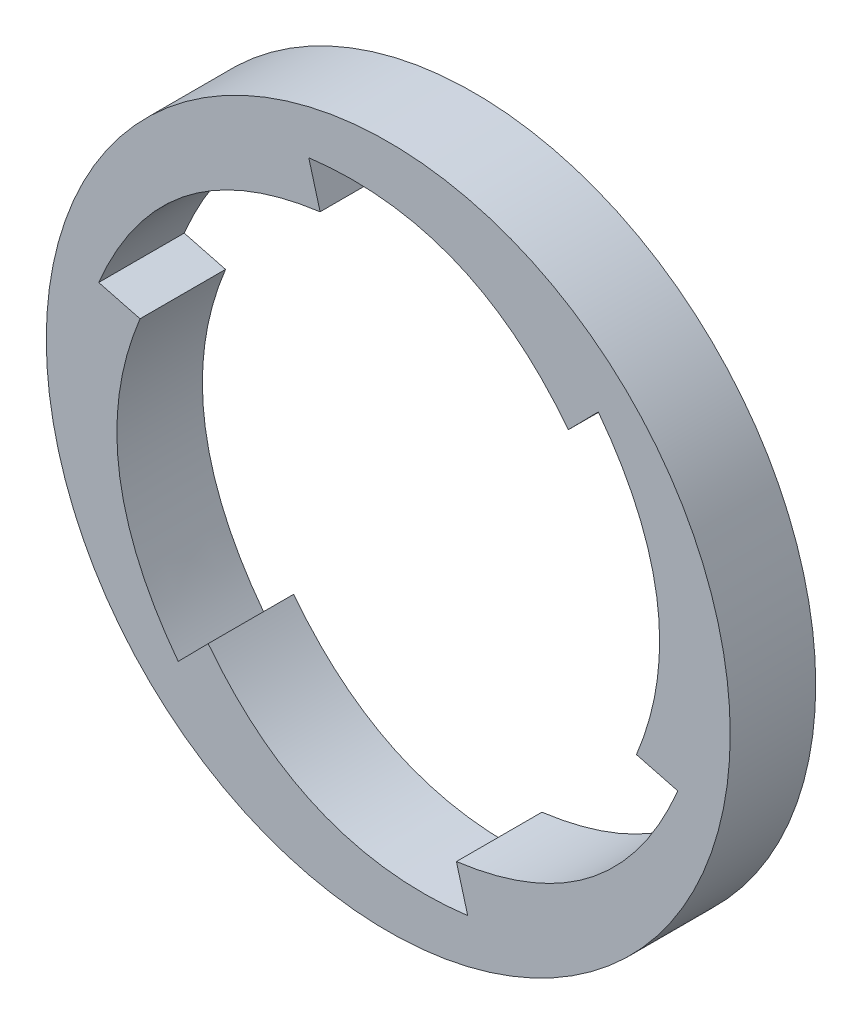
ISO-10303-21;
HEADER;
FILE_DESCRIPTION(('STEP AP214'),'2;1');
FILE_NAME('part.step','',(''),(''),'','','');
FILE_SCHEMA(('AUTOMOTIVE_DESIGN { 1 0 10303 214 1 1 1 1 }'));
ENDSEC;
DATA;
#1=APPLICATION_CONTEXT('core data for automotive mechanical design processes');
#2=APPLICATION_PROTOCOL_DEFINITION('international standard','automotive_design',2000,#1);
#3=PRODUCT_CONTEXT('',#1,'mechanical');
#4=PRODUCT('Part','Part','',(#3));
#5=PRODUCT_RELATED_PRODUCT_CATEGORY('part','',(#4));
#6=PRODUCT_DEFINITION_FORMATION('','',#4);
#7=PRODUCT_DEFINITION_CONTEXT('part definition',#1,'design');
#8=PRODUCT_DEFINITION('design','',#6,#7);
#9=PRODUCT_DEFINITION_SHAPE('','',#8);
#10=(LENGTH_UNIT() NAMED_UNIT(*) SI_UNIT(.MILLI.,.METRE.));
#11=(NAMED_UNIT(*) PLANE_ANGLE_UNIT() SI_UNIT($,.RADIAN.));
#12=(NAMED_UNIT(*) SI_UNIT($,.STERADIAN.) SOLID_ANGLE_UNIT());
#13=UNCERTAINTY_MEASURE_WITH_UNIT(LENGTH_MEASURE(1.E-05),#10,'distance_accuracy_value','');
#14=(GEOMETRIC_REPRESENTATION_CONTEXT(3) GLOBAL_UNCERTAINTY_ASSIGNED_CONTEXT((#13)) GLOBAL_UNIT_ASSIGNED_CONTEXT((#10,
#11,#12)) REPRESENTATION_CONTEXT('',''));
#15=CARTESIAN_POINT('',(0.,0.,0.));
#16=DIRECTION('',(0.,0.,1.));
#17=DIRECTION('',(1.,0.,0.));
#18=AXIS2_PLACEMENT_3D('',#15,#16,#17);
#19=CARTESIAN_POINT('',(0.,0.,6.35));
#20=DIRECTION('',(0.,0.,1.));
#21=DIRECTION('',(1.,0.,0.));
#22=AXIS2_PLACEMENT_3D('',#19,#20,#21);
#23=PLANE('',#22);
#24=CARTESIAN_POINT('',(0.,0.,6.35));
#25=DIRECTION('',(0.,0.,1.));
#26=DIRECTION('',(1.,0.,0.));
#27=AXIS2_PLACEMENT_3D('',#24,#25,#26);
#28=CIRCLE('',#27,25.4);
#29=CARTESIAN_POINT('',(25.4,0.,6.35));
#30=VERTEX_POINT('',#29);
#31=EDGE_CURVE('E11',#30,#30,#28,.T.);
#32=ORIENTED_EDGE('',*,*,#31,.T.);
#33=EDGE_LOOP('',(#32));
#34=FACE_BOUND('',#33,.T.);
#35=DIRECTION('',(0.265674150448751,-0.964062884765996,0.));
#36=VECTOR('',#35,1.);
#37=CARTESIAN_POINT('',(-5.90353795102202,21.4224147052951,6.35));
#38=LINE('',#37,#36);
#39=CARTESIAN_POINT('',(-5.90353795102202,21.4224147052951,6.35));
#40=VERTEX_POINT('',#39);
#41=CARTESIAN_POINT('',(-5.06109256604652,18.3653979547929,6.35));
#42=VERTEX_POINT('',#41);
#43=EDGE_CURVE('E146',#40,#42,#38,.T.);
#44=ORIENTED_EDGE('',*,*,#43,.F.);
#45=CARTESIAN_POINT('',(13.3743548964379,13.5657337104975,6.35));
#46=CARTESIAN_POINT('',(6.16341869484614,22.9446137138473,6.35));
#47=CARTESIAN_POINT('',(-5.90353795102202,21.4224147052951,6.35));
#48=B_SPLINE_CURVE_WITH_KNOTS('',2,(#45,#46,#47),.UNSPECIFIED.,.F.,.F.,(3,3),(0.,1.),.UNSPECIFIED.);
#49=CARTESIAN_POINT('',(13.3743548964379,13.5657337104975,6.35));
#50=VERTEX_POINT('',#49);
#51=EDGE_CURVE('E137',#50,#40,#48,.T.);
#52=ORIENTED_EDGE('',*,*,#51,.F.);
#53=DIRECTION('',(-0.70206587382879,-0.712112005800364,0.));
#54=VECTOR('',#53,1.);
#55=CARTESIAN_POINT('',(15.60058636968,15.8238211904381,6.35));
#56=LINE('',#55,#54);
#57=CARTESIAN_POINT('',(15.60058636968,15.8238211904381,6.35));
#58=VERTEX_POINT('',#57);
#59=EDGE_CURVE('E210',#58,#50,#56,.T.);
#60=ORIENTED_EDGE('',*,*,#59,.F.);
#61=CARTESIAN_POINT('',(18.4354474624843,-4.79966424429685,6.35));
#62=CARTESIAN_POINT('',(22.952327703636,6.13462969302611,6.35));
#63=CARTESIAN_POINT('',(15.60058636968,15.8238211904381,6.35));
#64=B_SPLINE_CURVE_WITH_KNOTS('',2,(#61,#62,#63),.UNSPECIFIED.,.F.,.F.,(3,3),(0.,1.),.UNSPECIFIED.);
#65=CARTESIAN_POINT('',(18.4354474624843,-4.79966424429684,6.35));
#66=VERTEX_POINT('',#65);
#67=EDGE_CURVE('E339',#66,#58,#64,.T.);
#68=ORIENTED_EDGE('',*,*,#67,.F.);
#69=DIRECTION('',(-0.9677400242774,0.251950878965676,0.));
#70=VECTOR('',#69,1.);
#71=CARTESIAN_POINT('',(21.5041243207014,-5.59859351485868,6.35));
#72=LINE('',#71,#70);
#73=CARTESIAN_POINT('',(21.5041243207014,-5.59859351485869,6.35));
#74=VERTEX_POINT('',#73);
#75=EDGE_CURVE('E335',#74,#66,#72,.T.);
#76=ORIENTED_EDGE('',*,*,#75,.F.);
#77=CARTESIAN_POINT('',(5.06109256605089,-18.3653979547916,6.35));
#78=CARTESIAN_POINT('',(16.7889090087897,-16.8099840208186,6.35));
#79=CARTESIAN_POINT('',(21.5041243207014,-5.59859351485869,6.35));
#80=B_SPLINE_CURVE_WITH_KNOTS('',2,(#77,#78,#79),.UNSPECIFIED.,.F.,.F.,(3,3),(0.,1.),.UNSPECIFIED.);
#81=CARTESIAN_POINT('',(5.06109256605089,-18.3653979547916,6.35));
#82=VERTEX_POINT('',#81);
#83=EDGE_CURVE('E343',#82,#74,#80,.T.);
#84=ORIENTED_EDGE('',*,*,#83,.F.);
#85=DIRECTION('',(-0.265674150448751,0.964062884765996,0.));
#86=VECTOR('',#85,1.);
#87=CARTESIAN_POINT('',(5.90353795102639,-21.4224147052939,6.35));
#88=LINE('',#87,#86);
#89=CARTESIAN_POINT('',(5.90353795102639,-21.4224147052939,6.35));
#90=VERTEX_POINT('',#89);
#91=EDGE_CURVE('E324',#90,#82,#88,.T.);
#92=ORIENTED_EDGE('',*,*,#91,.F.);
#93=CARTESIAN_POINT('',(-13.374354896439,-13.5657337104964,6.35));
#94=CARTESIAN_POINT('',(-6.16341869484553,-22.9446137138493,6.35));
#95=CARTESIAN_POINT('',(5.90353795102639,-21.4224147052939,6.35));
#96=B_SPLINE_CURVE_WITH_KNOTS('',2,(#93,#94,#95),.UNSPECIFIED.,.F.,.F.,(3,3),(0.,1.),.UNSPECIFIED.);
#97=CARTESIAN_POINT('',(-13.374354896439,-13.5657337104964,6.35));
#98=VERTEX_POINT('',#97);
#99=EDGE_CURVE('E318',#98,#90,#96,.T.);
#100=ORIENTED_EDGE('',*,*,#99,.F.);
#101=DIRECTION('',(0.70206587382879,0.712112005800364,0.));
#102=VECTOR('',#101,1.);
#103=CARTESIAN_POINT('',(-15.6005863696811,-15.8238211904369,6.35));
#104=LINE('',#103,#102);
#105=CARTESIAN_POINT('',(-15.6005863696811,-15.8238211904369,6.35));
#106=VERTEX_POINT('',#105);
#107=EDGE_CURVE('E376',#106,#98,#104,.T.);
#108=ORIENTED_EDGE('',*,*,#107,.F.);
#109=CARTESIAN_POINT('',(-18.4354474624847,4.79966424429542,6.35));
#110=CARTESIAN_POINT('',(-22.9523277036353,-6.13462969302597,6.35));
#111=CARTESIAN_POINT('',(-15.6005863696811,-15.8238211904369,6.35));
#112=B_SPLINE_CURVE_WITH_KNOTS('',2,(#109,#110,#111),.UNSPECIFIED.,.F.,.F.,(3,3),(0.,1.),.UNSPECIFIED.);
#113=CARTESIAN_POINT('',(-18.4354474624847,4.79966424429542,6.35));
#114=VERTEX_POINT('',#113);
#115=EDGE_CURVE('E307',#114,#106,#112,.T.);
#116=ORIENTED_EDGE('',*,*,#115,.F.);
#117=DIRECTION('',(0.9677400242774,-0.251950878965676,0.));
#118=VECTOR('',#117,1.);
#119=CARTESIAN_POINT('',(-18.4354474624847,4.79966424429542,6.35));
#120=LINE('',#119,#118);
#121=CARTESIAN_POINT('',(-21.5041243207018,5.59859351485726,6.35));
#122=VERTEX_POINT('',#121);
#123=EDGE_CURVE('E161',#122,#114,#120,.T.);
#124=ORIENTED_EDGE('',*,*,#123,.F.);
#125=CARTESIAN_POINT('',(-5.06109256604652,18.3653979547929,6.35));
#126=CARTESIAN_POINT('',(-16.7889090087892,16.8099840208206,6.35));
#127=CARTESIAN_POINT('',(-21.5041243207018,5.59859351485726,6.35));
#128=B_SPLINE_CURVE_WITH_KNOTS('',2,(#125,#126,#127),.UNSPECIFIED.,.F.,.F.,(3,3),(0.,1.),.UNSPECIFIED.);
#129=EDGE_CURVE('E158',#42,#122,#128,.T.);
#130=ORIENTED_EDGE('',*,*,#129,.F.);
#131=EDGE_LOOP('',(#44,#52,#60,#68,#76,#84,#92,#100,#108,#116,#124,#130));
#132=FACE_BOUND('',#131,.T.);
#133=ADVANCED_FACE('F38',(#34,#132),#23,.T.);
#134=CARTESIAN_POINT('',(0.,0.,0.));
#135=DIRECTION('',(0.,0.,1.));
#136=DIRECTION('',(1.,0.,0.));
#137=AXIS2_PLACEMENT_3D('',#134,#135,#136);
#138=PLANE('',#137);
#139=CARTESIAN_POINT('',(0.,0.,0.));
#140=DIRECTION('',(0.,0.,1.));
#141=DIRECTION('',(1.,0.,0.));
#142=AXIS2_PLACEMENT_3D('',#139,#140,#141);
#143=CIRCLE('',#142,25.4);
#144=CARTESIAN_POINT('',(25.4,0.,0.));
#145=VERTEX_POINT('',#144);
#146=EDGE_CURVE('E42',#145,#145,#143,.T.);
#147=ORIENTED_EDGE('',*,*,#146,.F.);
#148=EDGE_LOOP('',(#147));
#149=FACE_BOUND('',#148,.T.);
#150=CARTESIAN_POINT('',(13.3743548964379,13.5657337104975,0.));
#151=CARTESIAN_POINT('',(6.16341869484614,22.9446137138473,0.));
#152=CARTESIAN_POINT('',(-5.90353795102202,21.4224147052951,0.));
#153=B_SPLINE_CURVE_WITH_KNOTS('',2,(#150,#151,#152),.UNSPECIFIED.,.F.,.F.,(3,3),(0.,1.),.UNSPECIFIED.);
#154=CARTESIAN_POINT('',(13.3743548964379,13.5657337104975,0.));
#155=VERTEX_POINT('',#154);
#156=CARTESIAN_POINT('',(-5.90353795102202,21.4224147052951,0.));
#157=VERTEX_POINT('',#156);
#158=EDGE_CURVE('E64',#155,#157,#153,.T.);
#159=ORIENTED_EDGE('',*,*,#158,.T.);
#160=DIRECTION('',(0.265674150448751,-0.964062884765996,0.));
#161=VECTOR('',#160,1.);
#162=CARTESIAN_POINT('',(-5.90353795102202,21.4224147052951,0.));
#163=LINE('',#162,#161);
#164=CARTESIAN_POINT('',(-5.06109256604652,18.3653979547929,0.));
#165=VERTEX_POINT('',#164);
#166=EDGE_CURVE('E153',#157,#165,#163,.T.);
#167=ORIENTED_EDGE('',*,*,#166,.T.);
#168=CARTESIAN_POINT('',(-5.06109256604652,18.3653979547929,0.));
#169=CARTESIAN_POINT('',(-16.7889090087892,16.8099840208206,0.));
#170=CARTESIAN_POINT('',(-21.5041243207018,5.59859351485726,0.));
#171=B_SPLINE_CURVE_WITH_KNOTS('',2,(#168,#169,#170),.UNSPECIFIED.,.F.,.F.,(3,3),(0.,1.),.UNSPECIFIED.);
#172=CARTESIAN_POINT('',(-21.5041243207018,5.59859351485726,0.));
#173=VERTEX_POINT('',#172);
#174=EDGE_CURVE('E205',#165,#173,#171,.T.);
#175=ORIENTED_EDGE('',*,*,#174,.T.);
#176=DIRECTION('',(0.9677400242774,-0.251950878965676,0.));
#177=VECTOR('',#176,1.);
#178=CARTESIAN_POINT('',(-18.4354474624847,4.79966424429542,0.));
#179=LINE('',#178,#177);
#180=CARTESIAN_POINT('',(-18.4354474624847,4.79966424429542,0.));
#181=VERTEX_POINT('',#180);
#182=EDGE_CURVE('E220',#173,#181,#179,.T.);
#183=ORIENTED_EDGE('',*,*,#182,.T.);
#184=CARTESIAN_POINT('',(-18.4354474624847,4.79966424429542,0.));
#185=CARTESIAN_POINT('',(-22.9523277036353,-6.13462969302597,0.));
#186=CARTESIAN_POINT('',(-15.6005863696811,-15.8238211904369,0.));
#187=B_SPLINE_CURVE_WITH_KNOTS('',2,(#184,#185,#186),.UNSPECIFIED.,.F.,.F.,(3,3),(0.,1.),.UNSPECIFIED.);
#188=CARTESIAN_POINT('',(-15.6005863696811,-15.8238211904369,0.));
#189=VERTEX_POINT('',#188);
#190=EDGE_CURVE('E227',#181,#189,#187,.T.);
#191=ORIENTED_EDGE('',*,*,#190,.T.);
#192=DIRECTION('',(0.70206587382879,0.712112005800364,0.));
#193=VECTOR('',#192,1.);
#194=CARTESIAN_POINT('',(-15.6005863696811,-15.8238211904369,0.));
#195=LINE('',#194,#193);
#196=CARTESIAN_POINT('',(-13.374354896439,-13.5657337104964,0.));
#197=VERTEX_POINT('',#196);
#198=EDGE_CURVE('E233',#189,#197,#195,.T.);
#199=ORIENTED_EDGE('',*,*,#198,.T.);
#200=CARTESIAN_POINT('',(-13.374354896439,-13.5657337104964,0.));
#201=CARTESIAN_POINT('',(-6.16341869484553,-22.9446137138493,0.));
#202=CARTESIAN_POINT('',(5.90353795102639,-21.4224147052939,0.));
#203=B_SPLINE_CURVE_WITH_KNOTS('',2,(#200,#201,#202),.UNSPECIFIED.,.F.,.F.,(3,3),(0.,1.),.UNSPECIFIED.);
#204=CARTESIAN_POINT('',(5.90353795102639,-21.4224147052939,0.));
#205=VERTEX_POINT('',#204);
#206=EDGE_CURVE('E239',#197,#205,#203,.T.);
#207=ORIENTED_EDGE('',*,*,#206,.T.);
#208=DIRECTION('',(-0.265674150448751,0.964062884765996,0.));
#209=VECTOR('',#208,1.);
#210=CARTESIAN_POINT('',(5.90353795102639,-21.4224147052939,0.));
#211=LINE('',#210,#209);
#212=CARTESIAN_POINT('',(5.06109256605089,-18.3653979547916,0.));
#213=VERTEX_POINT('',#212);
#214=EDGE_CURVE('E245',#205,#213,#211,.T.);
#215=ORIENTED_EDGE('',*,*,#214,.T.);
#216=CARTESIAN_POINT('',(5.06109256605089,-18.3653979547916,0.));
#217=CARTESIAN_POINT('',(16.7889090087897,-16.8099840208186,0.));
#218=CARTESIAN_POINT('',(21.5041243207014,-5.59859351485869,0.));
#219=B_SPLINE_CURVE_WITH_KNOTS('',2,(#216,#217,#218),.UNSPECIFIED.,.F.,.F.,(3,3),(0.,1.),.UNSPECIFIED.);
#220=CARTESIAN_POINT('',(21.5041243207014,-5.59859351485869,0.));
#221=VERTEX_POINT('',#220);
#222=EDGE_CURVE('E252',#213,#221,#219,.T.);
#223=ORIENTED_EDGE('',*,*,#222,.T.);
#224=DIRECTION('',(-0.9677400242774,0.251950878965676,0.));
#225=VECTOR('',#224,1.);
#226=CARTESIAN_POINT('',(21.5041243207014,-5.59859351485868,0.));
#227=LINE('',#226,#225);
#228=CARTESIAN_POINT('',(18.4354474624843,-4.79966424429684,0.));
#229=VERTEX_POINT('',#228);
#230=EDGE_CURVE('E258',#221,#229,#227,.T.);
#231=ORIENTED_EDGE('',*,*,#230,.T.);
#232=CARTESIAN_POINT('',(18.4354474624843,-4.79966424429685,0.));
#233=CARTESIAN_POINT('',(22.952327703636,6.13462969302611,0.));
#234=CARTESIAN_POINT('',(15.60058636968,15.8238211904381,0.));
#235=B_SPLINE_CURVE_WITH_KNOTS('',2,(#232,#233,#234),.UNSPECIFIED.,.F.,.F.,(3,3),(0.,1.),.UNSPECIFIED.);
#236=CARTESIAN_POINT('',(15.60058636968,15.8238211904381,0.));
#237=VERTEX_POINT('',#236);
#238=EDGE_CURVE('E264',#229,#237,#235,.T.);
#239=ORIENTED_EDGE('',*,*,#238,.T.);
#240=DIRECTION('',(-0.70206587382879,-0.712112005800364,0.));
#241=VECTOR('',#240,1.);
#242=CARTESIAN_POINT('',(15.60058636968,15.8238211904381,0.));
#243=LINE('',#242,#241);
#244=EDGE_CURVE('E147',#237,#155,#243,.T.);
#245=ORIENTED_EDGE('',*,*,#244,.T.);
#246=EDGE_LOOP('',(#159,#167,#175,#183,#191,#199,#207,#215,#223,#231,#239,#245));
#247=FACE_BOUND('',#246,.T.);
#248=ADVANCED_FACE('F187',(#149,#247),#138,.F.);
#249=CARTESIAN_POINT('',(0.,0.,6.35));
#250=DIRECTION('',(0.,0.,-1.));
#251=DIRECTION('',(-1.,0.,0.));
#252=AXIS2_PLACEMENT_3D('',#249,#250,#251);
#253=CYLINDRICAL_SURFACE('',#252,25.4);
#254=ORIENTED_EDGE('',*,*,#31,.F.);
#255=EDGE_LOOP('',(#254));
#256=FACE_BOUND('',#255,.T.);
#257=ORIENTED_EDGE('',*,*,#146,.T.);
#258=EDGE_LOOP('',(#257));
#259=FACE_BOUND('',#258,.T.);
#260=ADVANCED_FACE('F40',(#256,#259),#253,.T.);
#261=DIRECTION('',(0.,0.,-1.));
#262=VECTOR('',#261,1.);
#263=SURFACE_OF_LINEAR_EXTRUSION('',#48,#262);
#264=ORIENTED_EDGE('',*,*,#158,.F.);
#265=DIRECTION('',(0.,0.,-1.));
#266=VECTOR('',#265,1.);
#267=CARTESIAN_POINT('',(13.3743548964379,13.5657337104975,6.35));
#268=LINE('',#267,#266);
#269=EDGE_CURVE('E141',#50,#155,#268,.T.);
#270=ORIENTED_EDGE('',*,*,#269,.F.);
#271=ORIENTED_EDGE('',*,*,#51,.T.);
#272=DIRECTION('',(0.,0.,-1.));
#273=VECTOR('',#272,1.);
#274=CARTESIAN_POINT('',(-5.90353795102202,21.4224147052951,6.35));
#275=LINE('',#274,#273);
#276=EDGE_CURVE('E140',#40,#157,#275,.T.);
#277=ORIENTED_EDGE('',*,*,#276,.T.);
#278=EDGE_LOOP('',(#264,#270,#271,#277));
#279=FACE_BOUND('',#278,.T.);
#280=ADVANCED_FACE('F139',(#279),#263,.T.);
#281=CARTESIAN_POINT('',(-5.90353795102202,21.4224147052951,6.35));
#282=DIRECTION('',(0.964062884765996,0.265674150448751,0.));
#283=DIRECTION('',(-0.265674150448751,0.964062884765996,0.));
#284=AXIS2_PLACEMENT_3D('',#281,#282,#283);
#285=PLANE('',#284);
#286=ORIENTED_EDGE('',*,*,#166,.F.);
#287=ORIENTED_EDGE('',*,*,#276,.F.);
#288=ORIENTED_EDGE('',*,*,#43,.T.);
#289=DIRECTION('',(0.,0.,-1.));
#290=VECTOR('',#289,1.);
#291=CARTESIAN_POINT('',(-5.06109256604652,18.3653979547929,6.35));
#292=LINE('',#291,#290);
#293=EDGE_CURVE('E154',#42,#165,#292,.T.);
#294=ORIENTED_EDGE('',*,*,#293,.T.);
#295=EDGE_LOOP('',(#286,#287,#288,#294));
#296=FACE_BOUND('',#295,.T.);
#297=ADVANCED_FACE('F150',(#296),#285,.T.);
#298=DIRECTION('',(0.,0.,-1.));
#299=VECTOR('',#298,1.);
#300=SURFACE_OF_LINEAR_EXTRUSION('',#128,#299);
#301=ORIENTED_EDGE('',*,*,#174,.F.);
#302=ORIENTED_EDGE('',*,*,#293,.F.);
#303=ORIENTED_EDGE('',*,*,#129,.T.);
#304=DIRECTION('',(0.,0.,-1.));
#305=VECTOR('',#304,1.);
#306=CARTESIAN_POINT('',(-21.5041243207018,5.59859351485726,6.35));
#307=LINE('',#306,#305);
#308=EDGE_CURVE('E293',#122,#173,#307,.T.);
#309=ORIENTED_EDGE('',*,*,#308,.T.);
#310=EDGE_LOOP('',(#301,#302,#303,#309));
#311=FACE_BOUND('',#310,.T.);
#312=ADVANCED_FACE('F175',(#311),#300,.T.);
#313=CARTESIAN_POINT('',(-18.4354474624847,4.79966424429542,6.35));
#314=DIRECTION('',(0.251950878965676,0.9677400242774,0.));
#315=DIRECTION('',(-0.9677400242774,0.251950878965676,0.));
#316=AXIS2_PLACEMENT_3D('',#313,#314,#315);
#317=PLANE('',#316);
#318=ORIENTED_EDGE('',*,*,#182,.F.);
#319=ORIENTED_EDGE('',*,*,#308,.F.);
#320=ORIENTED_EDGE('',*,*,#123,.T.);
#321=DIRECTION('',(0.,0.,-1.));
#322=VECTOR('',#321,1.);
#323=CARTESIAN_POINT('',(-18.4354474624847,4.79966424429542,6.35));
#324=LINE('',#323,#322);
#325=EDGE_CURVE('E290',#114,#181,#324,.T.);
#326=ORIENTED_EDGE('',*,*,#325,.T.);
#327=EDGE_LOOP('',(#318,#319,#320,#326));
#328=FACE_BOUND('',#327,.T.);
#329=ADVANCED_FACE('F179',(#328),#317,.T.);
#330=DIRECTION('',(0.,0.,-1.));
#331=VECTOR('',#330,1.);
#332=SURFACE_OF_LINEAR_EXTRUSION('',#112,#331);
#333=ORIENTED_EDGE('',*,*,#190,.F.);
#334=ORIENTED_EDGE('',*,*,#325,.F.);
#335=ORIENTED_EDGE('',*,*,#115,.T.);
#336=DIRECTION('',(0.,0.,-1.));
#337=VECTOR('',#336,1.);
#338=CARTESIAN_POINT('',(-15.6005863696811,-15.8238211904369,6.35));
#339=LINE('',#338,#337);
#340=EDGE_CURVE('E288',#106,#189,#339,.T.);
#341=ORIENTED_EDGE('',*,*,#340,.T.);
#342=EDGE_LOOP('',(#333,#334,#335,#341));
#343=FACE_BOUND('',#342,.T.);
#344=ADVANCED_FACE('F304',(#343),#332,.T.);
#345=CARTESIAN_POINT('',(-15.6005863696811,-15.8238211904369,6.35));
#346=DIRECTION('',(-0.712112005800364,0.70206587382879,0.));
#347=DIRECTION('',(-0.70206587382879,-0.712112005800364,0.));
#348=AXIS2_PLACEMENT_3D('',#345,#346,#347);
#349=PLANE('',#348);
#350=ORIENTED_EDGE('',*,*,#198,.F.);
#351=ORIENTED_EDGE('',*,*,#340,.F.);
#352=ORIENTED_EDGE('',*,*,#107,.T.);
#353=DIRECTION('',(0.,0.,-1.));
#354=VECTOR('',#353,1.);
#355=CARTESIAN_POINT('',(-13.374354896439,-13.5657337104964,6.35));
#356=LINE('',#355,#354);
#357=EDGE_CURVE('E286',#98,#197,#356,.T.);
#358=ORIENTED_EDGE('',*,*,#357,.T.);
#359=EDGE_LOOP('',(#350,#351,#352,#358));
#360=FACE_BOUND('',#359,.T.);
#361=ADVANCED_FACE('F310',(#360),#349,.T.);
#362=DIRECTION('',(0.,0.,-1.));
#363=VECTOR('',#362,1.);
#364=SURFACE_OF_LINEAR_EXTRUSION('',#96,#363);
#365=ORIENTED_EDGE('',*,*,#206,.F.);
#366=ORIENTED_EDGE('',*,*,#357,.F.);
#367=ORIENTED_EDGE('',*,*,#99,.T.);
#368=DIRECTION('',(0.,0.,-1.));
#369=VECTOR('',#368,1.);
#370=CARTESIAN_POINT('',(5.90353795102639,-21.4224147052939,6.35));
#371=LINE('',#370,#369);
#372=EDGE_CURVE('E283',#90,#205,#371,.T.);
#373=ORIENTED_EDGE('',*,*,#372,.T.);
#374=EDGE_LOOP('',(#365,#366,#367,#373));
#375=FACE_BOUND('',#374,.T.);
#376=ADVANCED_FACE('F315',(#375),#364,.T.);
#377=CARTESIAN_POINT('',(5.90353795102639,-21.4224147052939,6.35));
#378=DIRECTION('',(-0.964062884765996,-0.265674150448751,0.));
#379=DIRECTION('',(0.265674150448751,-0.964062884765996,0.));
#380=AXIS2_PLACEMENT_3D('',#377,#378,#379);
#381=PLANE('',#380);
#382=ORIENTED_EDGE('',*,*,#214,.F.);
#383=ORIENTED_EDGE('',*,*,#372,.F.);
#384=ORIENTED_EDGE('',*,*,#91,.T.);
#385=DIRECTION('',(0.,0.,-1.));
#386=VECTOR('',#385,1.);
#387=CARTESIAN_POINT('',(5.06109256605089,-18.3653979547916,6.35));
#388=LINE('',#387,#386);
#389=EDGE_CURVE('E280',#82,#213,#388,.T.);
#390=ORIENTED_EDGE('',*,*,#389,.T.);
#391=EDGE_LOOP('',(#382,#383,#384,#390));
#392=FACE_BOUND('',#391,.T.);
#393=ADVANCED_FACE('F321',(#392),#381,.T.);
#394=DIRECTION('',(0.,0.,-1.));
#395=VECTOR('',#394,1.);
#396=SURFACE_OF_LINEAR_EXTRUSION('',#80,#395);
#397=ORIENTED_EDGE('',*,*,#222,.F.);
#398=ORIENTED_EDGE('',*,*,#389,.F.);
#399=ORIENTED_EDGE('',*,*,#83,.T.);
#400=DIRECTION('',(0.,0.,-1.));
#401=VECTOR('',#400,1.);
#402=CARTESIAN_POINT('',(21.5041243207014,-5.59859351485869,6.35));
#403=LINE('',#402,#401);
#404=EDGE_CURVE('E278',#74,#221,#403,.T.);
#405=ORIENTED_EDGE('',*,*,#404,.T.);
#406=EDGE_LOOP('',(#397,#398,#399,#405));
#407=FACE_BOUND('',#406,.T.);
#408=ADVANCED_FACE('F327',(#407),#396,.T.);
#409=CARTESIAN_POINT('',(21.5041243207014,-5.59859351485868,6.35));
#410=DIRECTION('',(-0.251950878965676,-0.9677400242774,0.));
#411=DIRECTION('',(0.9677400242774,-0.251950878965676,0.));
#412=AXIS2_PLACEMENT_3D('',#409,#410,#411);
#413=PLANE('',#412);
#414=ORIENTED_EDGE('',*,*,#230,.F.);
#415=ORIENTED_EDGE('',*,*,#404,.F.);
#416=ORIENTED_EDGE('',*,*,#75,.T.);
#417=DIRECTION('',(0.,0.,-1.));
#418=VECTOR('',#417,1.);
#419=CARTESIAN_POINT('',(18.4354474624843,-4.79966424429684,6.35));
#420=LINE('',#419,#418);
#421=EDGE_CURVE('E276',#66,#229,#420,.T.);
#422=ORIENTED_EDGE('',*,*,#421,.T.);
#423=EDGE_LOOP('',(#414,#415,#416,#422));
#424=FACE_BOUND('',#423,.T.);
#425=ADVANCED_FACE('F332',(#424),#413,.T.);
#426=DIRECTION('',(0.,0.,-1.));
#427=VECTOR('',#426,1.);
#428=SURFACE_OF_LINEAR_EXTRUSION('',#64,#427);
#429=ORIENTED_EDGE('',*,*,#238,.F.);
#430=ORIENTED_EDGE('',*,*,#421,.F.);
#431=ORIENTED_EDGE('',*,*,#67,.T.);
#432=DIRECTION('',(0.,0.,-1.));
#433=VECTOR('',#432,1.);
#434=CARTESIAN_POINT('',(15.60058636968,15.8238211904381,6.35));
#435=LINE('',#434,#433);
#436=EDGE_CURVE('E54',#58,#237,#435,.T.);
#437=ORIENTED_EDGE('',*,*,#436,.T.);
#438=EDGE_LOOP('',(#429,#430,#431,#437));
#439=FACE_BOUND('',#438,.T.);
#440=ADVANCED_FACE('F338',(#439),#428,.T.);
#441=CARTESIAN_POINT('',(15.60058636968,15.8238211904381,6.35));
#442=DIRECTION('',(0.712112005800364,-0.70206587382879,0.));
#443=DIRECTION('',(0.70206587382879,0.712112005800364,0.));
#444=AXIS2_PLACEMENT_3D('',#441,#442,#443);
#445=PLANE('',#444);
#446=ORIENTED_EDGE('',*,*,#244,.F.);
#447=ORIENTED_EDGE('',*,*,#436,.F.);
#448=ORIENTED_EDGE('',*,*,#59,.T.);
#449=ORIENTED_EDGE('',*,*,#269,.T.);
#450=EDGE_LOOP('',(#446,#447,#448,#449));
#451=FACE_BOUND('',#450,.T.);
#452=ADVANCED_FACE('F340',(#451),#445,.T.);
#453=CLOSED_SHELL('',(#133,#248,#260,#280,#297,#312,#329,#344,#361,#376,#393,#408,#425,#440,#452));
#454=MANIFOLD_SOLID_BREP('B2',#453);
#455=ADVANCED_BREP_SHAPE_REPRESENTATION('',(#18,#454),#14);
#456=SHAPE_DEFINITION_REPRESENTATION(#9,#455);
ENDSEC;
END-ISO-10303-21;
